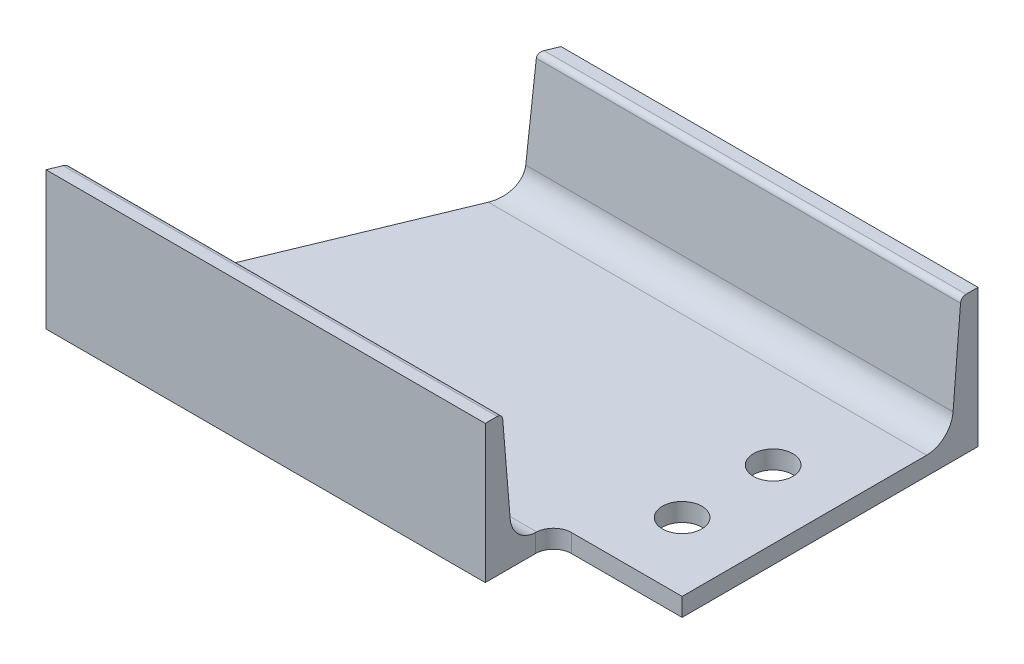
ISO-10303-21;
HEADER;
FILE_DESCRIPTION(('STEP AP214'),'2;1');
FILE_NAME('part.step','',(''),(''),'','','');
FILE_SCHEMA(('AUTOMOTIVE_DESIGN { 1 0 10303 214 1 1 1 1 }'));
ENDSEC;
DATA;
#1=APPLICATION_CONTEXT('core data for automotive mechanical design processes');
#2=APPLICATION_PROTOCOL_DEFINITION('international standard','automotive_design',2000,#1);
#3=PRODUCT_CONTEXT('',#1,'mechanical');
#4=PRODUCT('Part','Part','',(#3));
#5=PRODUCT_RELATED_PRODUCT_CATEGORY('part','',(#4));
#6=PRODUCT_DEFINITION_FORMATION('','',#4);
#7=PRODUCT_DEFINITION_CONTEXT('part definition',#1,'design');
#8=PRODUCT_DEFINITION('design','',#6,#7);
#9=PRODUCT_DEFINITION_SHAPE('','',#8);
#10=(LENGTH_UNIT() NAMED_UNIT(*) SI_UNIT(.MILLI.,.METRE.));
#11=(NAMED_UNIT(*) PLANE_ANGLE_UNIT() SI_UNIT($,.RADIAN.));
#12=(NAMED_UNIT(*) SI_UNIT($,.STERADIAN.) SOLID_ANGLE_UNIT());
#13=UNCERTAINTY_MEASURE_WITH_UNIT(LENGTH_MEASURE(1.E-05),#10,'distance_accuracy_value','');
#14=(GEOMETRIC_REPRESENTATION_CONTEXT(3) GLOBAL_UNCERTAINTY_ASSIGNED_CONTEXT((#13)) GLOBAL_UNIT_ASSIGNED_CONTEXT((#10,
#11,#12)) REPRESENTATION_CONTEXT('',''));
#15=CARTESIAN_POINT('',(0.,0.,0.));
#16=DIRECTION('',(0.,0.,1.));
#17=DIRECTION('',(1.,0.,0.));
#18=AXIS2_PLACEMENT_3D('',#15,#16,#17);
#19=CARTESIAN_POINT('',(345.,24.9951564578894,-174.498));
#20=DIRECTION('',(-1.,0.,0.));
#21=DIRECTION('',(0.,0.,1.));
#22=AXIS2_PLACEMENT_3D('',#19,#20,#21);
#23=CYLINDRICAL_SURFACE('',#22,14.8351564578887);
#24=DIRECTION('',(-1.,0.,0.));
#25=VECTOR('',#24,1.);
#26=CARTESIAN_POINT('',(345.,10.1600000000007,-174.498));
#27=LINE('',#26,#25);
#28=CARTESIAN_POINT('',(316.849999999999,10.1600000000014,-174.497999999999));
#29=VERTEX_POINT('',#28);
#30=CARTESIAN_POINT('',(72.2794382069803,10.1600000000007,-174.498));
#31=VERTEX_POINT('',#30);
#32=EDGE_CURVE('E255',#29,#31,#27,.T.);
#33=ORIENTED_EDGE('',*,*,#32,.F.);
#34=CARTESIAN_POINT('',(316.849999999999,24.9951564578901,-174.497999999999));
#35=DIRECTION('',(1.,0.,0.));
#36=DIRECTION('',(0.,0.,-1.));
#37=AXIS2_PLACEMENT_3D('',#34,#35,#36);
#38=CIRCLE('',#37,14.8351564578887);
#39=CARTESIAN_POINT('',(316.849999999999,23.7715448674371,-189.282608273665));
#40=VERTEX_POINT('',#39);
#41=EDGE_CURVE('E340',#40,#29,#38,.F.);
#42=ORIENTED_EDGE('',*,*,#41,.F.);
#43=DIRECTION('',(-1.,0.,0.));
#44=VECTOR('',#43,1.);
#45=CARTESIAN_POINT('',(345.,23.7715448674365,-189.282608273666));
#46=LINE('',#45,#44);
#47=CARTESIAN_POINT('',(78.4034234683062,23.7715448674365,-189.282608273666));
#48=VERTEX_POINT('',#47);
#49=EDGE_CURVE('E229',#40,#48,#46,.T.);
#50=ORIENTED_EDGE('',*,*,#49,.T.);
#51=CARTESIAN_POINT('',(72.2794382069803,24.9951564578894,-174.498));
#52=DIRECTION('',(-0.923879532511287,0.,-0.38268343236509));
#53=DIRECTION('',(-0.38268343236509,0.,0.923879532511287));
#54=AXIS2_PLACEMENT_3D('',#51,#52,#53);
#55=ELLIPSE('',#54,16.0574576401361,14.8351564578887);
#56=EDGE_CURVE('E252',#48,#31,#55,.T.);
#57=ORIENTED_EDGE('',*,*,#56,.T.);
#58=EDGE_LOOP('',(#33,#42,#50,#57));
#59=FACE_BOUND('',#58,.T.);
#60=ADVANCED_FACE('F79',(#59),#23,.F.);
#61=CARTESIAN_POINT('',(345.,24.9951564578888,-28.7019999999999));
#62=DIRECTION('',(-1.,0.,0.));
#63=DIRECTION('',(0.,0.,1.));
#64=AXIS2_PLACEMENT_3D('',#61,#62,#63);
#65=CYLINDRICAL_SURFACE('',#64,14.8351564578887);
#66=CARTESIAN_POINT('',(245.099999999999,10.1722193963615,-28.0999999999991));
#67=CARTESIAN_POINT('',(245.099999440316,10.1681446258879,-28.2003830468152));
#68=CARTESIAN_POINT('',(245.101510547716,10.1650889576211,-28.30074123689));
#69=CARTESIAN_POINT('',(245.107556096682,10.1610158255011,-28.5014079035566));
#70=CARTESIAN_POINT('',(245.112090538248,10.1599983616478,-28.6017163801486));
#71=CARTESIAN_POINT('',(245.118136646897,10.1600000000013,-28.7019999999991));
#72=B_SPLINE_CURVE_WITH_KNOTS('',3,(#66,#67,#68,#69,#70,#71),.UNSPECIFIED.,.F.,.F.,(4,2,4),(0.,
0.301248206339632,0.602496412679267),.UNSPECIFIED.);
#73=CARTESIAN_POINT('',(245.099999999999,10.1722193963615,-28.0999999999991));
#74=VERTEX_POINT('',#73);
#75=CARTESIAN_POINT('',(245.118136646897,10.1600000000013,-28.7019999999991));
#76=VERTEX_POINT('',#75);
#77=EDGE_CURVE('E201',#74,#76,#72,.T.);
#78=ORIENTED_EDGE('',*,*,#77,.T.);
#79=DIRECTION('',(-1.,0.,0.));
#80=VECTOR('',#79,1.);
#81=CARTESIAN_POINT('',(345.,10.1600000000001,-28.702));
#82=LINE('',#81,#80);
#83=CARTESIAN_POINT('',(11.8887576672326,10.1600000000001,-28.702));
#84=VERTEX_POINT('',#83);
#85=EDGE_CURVE('E259',#76,#84,#82,.T.);
#86=ORIENTED_EDGE('',*,*,#85,.T.);
#87=CARTESIAN_POINT('',(11.8887576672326,24.9951564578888,-28.7019999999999));
#88=DIRECTION('',(-0.923879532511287,0.,-0.38268343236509));
#89=DIRECTION('',(-0.38268343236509,0.,0.923879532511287));
#90=AXIS2_PLACEMENT_3D('',#87,#88,#89);
#91=ELLIPSE('',#90,16.0574576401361,14.8351564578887);
#92=CARTESIAN_POINT('',(5.76477240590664,23.7715448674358,-13.9173917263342));
#93=VERTEX_POINT('',#92);
#94=EDGE_CURVE('E251',#93,#84,#91,.F.);
#95=ORIENTED_EDGE('',*,*,#94,.F.);
#96=DIRECTION('',(-1.,0.,0.));
#97=VECTOR('',#96,1.);
#98=CARTESIAN_POINT('',(345.,23.7715448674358,-13.9173917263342));
#99=LINE('',#98,#97);
#100=CARTESIAN_POINT('',(245.099999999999,23.7715448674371,-13.9173917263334));
#101=VERTEX_POINT('',#100);
#102=EDGE_CURVE('E213',#101,#93,#99,.T.);
#103=ORIENTED_EDGE('',*,*,#102,.F.);
#104=CARTESIAN_POINT('',(245.099999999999,24.99515645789,-28.7019999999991));
#105=DIRECTION('',(1.,0.,0.));
#106=DIRECTION('',(0.,0.,-1.));
#107=AXIS2_PLACEMENT_3D('',#104,#105,#106);
#108=CIRCLE('',#107,14.8351564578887);
#109=EDGE_CURVE('E191',#101,#74,#108,.T.);
#110=ORIENTED_EDGE('',*,*,#109,.T.);
#111=EDGE_LOOP('',(#78,#86,#95,#103,#110));
#112=FACE_BOUND('',#111,.T.);
#113=ADVANCED_FACE('F211',(#112),#65,.F.);
#114=CARTESIAN_POINT('',(345.,74.1364296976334,-9.74906641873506));
#115=DIRECTION('',(0.,0.0824805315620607,-0.996592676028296));
#116=DIRECTION('',(0.,0.996592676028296,0.0824805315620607));
#117=AXIS2_PLACEMENT_3D('',#114,#115,#116);
#118=PLANE('',#117);
#119=DIRECTION('',(-1.,0.,0.));
#120=VECTOR('',#119,1.);
#121=CARTESIAN_POINT('',(345.,74.1364296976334,-9.74906641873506));
#122=LINE('',#121,#120);
#123=CARTESIAN_POINT('',(245.099999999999,74.1364296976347,-9.74906641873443));
#124=VERTEX_POINT('',#123);
#125=CARTESIAN_POINT('',(4.03819553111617,74.1364296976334,-9.74906641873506));
#126=VERTEX_POINT('',#125);
#127=EDGE_CURVE('E265',#124,#126,#122,.T.);
#128=ORIENTED_EDGE('',*,*,#127,.F.);
#129=DIRECTION('',(0.,0.996592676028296,0.0824805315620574));
#130=VECTOR('',#129,1.);
#131=CARTESIAN_POINT('',(245.099999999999,74.1364296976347,-9.74906641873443));
#132=LINE('',#131,#130);
#133=EDGE_CURVE('E303',#101,#124,#132,.T.);
#134=ORIENTED_EDGE('',*,*,#133,.F.);
#135=ORIENTED_EDGE('',*,*,#102,.T.);
#136=DIRECTION('',(-0.0341446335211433,0.996011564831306,0.0824324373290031));
#137=VECTOR('',#136,1.);
#138=CARTESIAN_POINT('',(4.43570789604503,62.5408472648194,-10.7087461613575));
#139=LINE('',#138,#137);
#140=EDGE_CURVE('E262',#93,#126,#139,.T.);
#141=ORIENTED_EDGE('',*,*,#140,.T.);
#142=EDGE_LOOP('',(#128,#134,#135,#141));
#143=FACE_BOUND('',#142,.T.);
#144=ADVANCED_FACE('F332',(#143),#118,.T.);
#145=CARTESIAN_POINT('',(345.,73.8824246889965,-6.67998421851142));
#146=DIRECTION('',(-1.,0.,0.));
#147=DIRECTION('',(0.,0.,1.));
#148=AXIS2_PLACEMENT_3D('',#145,#146,#147);
#149=CYLINDRICAL_SURFACE('',#148,3.0795753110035);
#150=CARTESIAN_POINT('',(245.099999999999,73.8824246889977,-6.67998421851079));
#151=DIRECTION('',(1.,0.,0.));
#152=DIRECTION('',(0.,0.,-1.));
#153=AXIS2_PLACEMENT_3D('',#150,#151,#152);
#154=CIRCLE('',#153,3.0795753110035);
#155=CARTESIAN_POINT('',(245.099999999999,76.9620000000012,-6.67998421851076));
#156=VERTEX_POINT('',#155);
#157=EDGE_CURVE('E306',#156,#124,#154,.F.);
#158=ORIENTED_EDGE('',*,*,#157,.T.);
#159=ORIENTED_EDGE('',*,*,#127,.T.);
#160=CARTESIAN_POINT('',(2.76694005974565,73.8824246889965,-6.67998421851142));
#161=DIRECTION('',(-0.923879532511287,0.,-0.38268343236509));
#162=DIRECTION('',(-0.38268343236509,0.,0.923879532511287));
#163=AXIS2_PLACEMENT_3D('',#160,#161,#162);
#164=ELLIPSE('',#163,3.33330829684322,3.0795753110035);
#165=CARTESIAN_POINT('',(2.76694005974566,76.962,-6.67998421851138));
#166=VERTEX_POINT('',#165);
#167=EDGE_CURVE('E231',#166,#126,#164,.T.);
#168=ORIENTED_EDGE('',*,*,#167,.F.);
#169=DIRECTION('',(-1.,0.,0.));
#170=VECTOR('',#169,1.);
#171=CARTESIAN_POINT('',(345.,76.962,-6.67998421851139));
#172=LINE('',#171,#170);
#173=EDGE_CURVE('E269',#156,#166,#172,.T.);
#174=ORIENTED_EDGE('',*,*,#173,.F.);
#175=EDGE_LOOP('',(#158,#159,#168,#174));
#176=FACE_BOUND('',#175,.T.);
#177=ADVANCED_FACE('F335',(#176),#149,.T.);
#178=CARTESIAN_POINT('',(345.,76.962,2.63677968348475E-13));
#179=DIRECTION('',(0.,1.,0.));
#180=DIRECTION('',(0.,0.,1.));
#181=AXIS2_PLACEMENT_3D('',#178,#179,#180);
#182=PLANE('',#181);
#183=DIRECTION('',(-1.,0.,0.));
#184=VECTOR('',#183,1.);
#185=CARTESIAN_POINT('',(345.,76.962,2.63677968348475E-13));
#186=LINE('',#185,#184);
#187=CARTESIAN_POINT('',(245.099999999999,76.962,2.63677968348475E-13));
#188=VERTEX_POINT('',#187);
#189=CARTESIAN_POINT('',(0.,76.9620000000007,0.));
#190=VERTEX_POINT('',#189);
#191=EDGE_CURVE('E103',#188,#190,#186,.T.);
#192=ORIENTED_EDGE('',*,*,#191,.F.);
#193=DIRECTION('',(0.,0.,1.));
#194=VECTOR('',#193,1.);
#195=CARTESIAN_POINT('',(245.099999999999,76.9620000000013,8.53124922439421E-13));
#196=LINE('',#195,#194);
#197=EDGE_CURVE('E96',#156,#188,#196,.T.);
#198=ORIENTED_EDGE('',*,*,#197,.F.);
#199=ORIENTED_EDGE('',*,*,#173,.T.);
#200=DIRECTION('',(-0.38268343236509,0.,0.923879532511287));
#201=VECTOR('',#200,1.);
#202=CARTESIAN_POINT('',(50.5240802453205,76.9619999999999,-121.975919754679));
#203=LINE('',#202,#201);
#204=EDGE_CURVE('E235',#166,#190,#203,.T.);
#205=ORIENTED_EDGE('',*,*,#204,.T.);
#206=EDGE_LOOP('',(#192,#198,#199,#205));
#207=FACE_BOUND('',#206,.T.);
#208=ADVANCED_FACE('F290',(#207),#182,.T.);
#209=CARTESIAN_POINT('',(345.,0.,0.));
#210=DIRECTION('',(0.,1.,0.));
#211=DIRECTION('',(0.,0.,1.));
#212=AXIS2_PLACEMENT_3D('',#209,#210,#211);
#213=PLANE('',#212);
#214=CARTESIAN_POINT('',(278.749999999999,2.63677968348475E-13,-76.1999999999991));
#215=DIRECTION('',(0.,1.,0.));
#216=DIRECTION('',(0.,0.,1.));
#217=AXIS2_PLACEMENT_3D('',#214,#215,#216);
#218=CIRCLE('',#217,11.);
#219=CARTESIAN_POINT('',(278.749999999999,2.24803518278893E-13,-65.1999999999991));
#220=VERTEX_POINT('',#219);
#221=EDGE_CURVE('E225',#220,#220,#218,.F.);
#222=ORIENTED_EDGE('',*,*,#221,.F.);
#223=EDGE_LOOP('',(#222));
#224=FACE_BOUND('',#223,.T.);
#225=CARTESIAN_POINT('',(278.749999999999,4.44089209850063E-13,-126.999999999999));
#226=DIRECTION('',(0.,1.,0.));
#227=DIRECTION('',(0.,0.,1.));
#228=AXIS2_PLACEMENT_3D('',#225,#226,#227);
#229=CIRCLE('',#228,11.);
#230=CARTESIAN_POINT('',(278.749999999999,4.05214759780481E-13,-115.999999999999));
#231=VERTEX_POINT('',#230);
#232=EDGE_CURVE('E83',#231,#231,#229,.F.);
#233=ORIENTED_EDGE('',*,*,#232,.F.);
#234=EDGE_LOOP('',(#233));
#235=FACE_BOUND('',#234,.T.);
#236=DIRECTION('',(0.,0.,1.));
#237=VECTOR('',#236,1.);
#238=CARTESIAN_POINT('',(316.849999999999,1.28332885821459E-12,8.38839928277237E-13));
#239=LINE('',#238,#237);
#240=CARTESIAN_POINT('',(316.849999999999,1.31686178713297E-12,-203.199999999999));
#241=VERTEX_POINT('',#240);
#242=CARTESIAN_POINT('',(316.849999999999,1.28142238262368E-12,-38.0999999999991));
#243=VERTEX_POINT('',#242);
#244=EDGE_CURVE('E297',#241,#243,#239,.T.);
#245=ORIENTED_EDGE('',*,*,#244,.T.);
#246=DIRECTION('',(-1.,0.,0.));
#247=VECTOR('',#246,1.);
#248=CARTESIAN_POINT('',(-55.0000000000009,1.28961628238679E-12,-38.0999999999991));
#249=LINE('',#248,#247);
#250=CARTESIAN_POINT('',(255.099999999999,1.28142238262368E-12,-38.0999999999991));
#251=VERTEX_POINT('',#250);
#252=EDGE_CURVE('E299',#243,#251,#249,.T.);
#253=ORIENTED_EDGE('',*,*,#252,.T.);
#254=CARTESIAN_POINT('',(255.099999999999,1.28019773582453E-12,-28.0999999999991));
#255=DIRECTION('',(0.,-1.,0.));
#256=DIRECTION('',(0.,0.,1.));
#257=AXIS2_PLACEMENT_3D('',#254,#255,#256);
#258=CIRCLE('',#257,9.99999999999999);
#259=CARTESIAN_POINT('',(245.099999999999,1.28019773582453E-12,-28.0999999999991));
#260=VERTEX_POINT('',#259);
#261=EDGE_CURVE('E207',#251,#260,#258,.F.);
#262=ORIENTED_EDGE('',*,*,#261,.T.);
#263=DIRECTION('',(0.,0.,1.));
#264=VECTOR('',#263,1.);
#265=CARTESIAN_POINT('',(245.099999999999,1.28332885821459E-12,8.39427546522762E-13));
#266=LINE('',#265,#264);
#267=CARTESIAN_POINT('',(245.099999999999,1.28332885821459E-12,8.75944198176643E-13));
#268=VERTEX_POINT('',#267);
#269=EDGE_CURVE('E194',#260,#268,#266,.T.);
#270=ORIENTED_EDGE('',*,*,#269,.T.);
#271=DIRECTION('',(-1.,0.,0.));
#272=VECTOR('',#271,1.);
#273=CARTESIAN_POINT('',(345.,0.,0.));
#274=LINE('',#273,#272);
#275=CARTESIAN_POINT('',(0.,0.,0.));
#276=VERTEX_POINT('',#275);
#277=EDGE_CURVE('E233',#268,#276,#274,.T.);
#278=ORIENTED_EDGE('',*,*,#277,.T.);
#279=DIRECTION('',(-0.38268343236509,0.,0.923879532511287));
#280=VECTOR('',#279,1.);
#281=CARTESIAN_POINT('',(50.5240802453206,4.26564272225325E-13,-121.975919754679));
#282=LINE('',#281,#280);
#283=CARTESIAN_POINT('',(84.1681958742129,7.13613495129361E-13,-203.2));
#284=VERTEX_POINT('',#283);
#285=EDGE_CURVE('E88',#284,#276,#282,.T.);
#286=ORIENTED_EDGE('',*,*,#285,.F.);
#287=DIRECTION('',(-1.,0.,0.));
#288=VECTOR('',#287,1.);
#289=CARTESIAN_POINT('',(345.,7.13613495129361E-13,-203.2));
#290=LINE('',#289,#288);
#291=EDGE_CURVE('E234',#241,#284,#290,.T.);
#292=ORIENTED_EDGE('',*,*,#291,.F.);
#293=EDGE_LOOP('',(#245,#253,#262,#270,#278,#286,#292));
#294=FACE_BOUND('',#293,.T.);
#295=ADVANCED_FACE('F286',(#224,#235,#294),#213,.F.);
#296=CARTESIAN_POINT('',(345.,7.13613495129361E-13,-203.2));
#297=DIRECTION('',(0.,0.,1.));
#298=DIRECTION('',(0.,-1.,0.));
#299=AXIS2_PLACEMENT_3D('',#296,#297,#298);
#300=PLANE('',#299);
#301=DIRECTION('',(0.,-1.,0.));
#302=VECTOR('',#301,1.);
#303=CARTESIAN_POINT('',(316.849999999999,1.31686178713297E-12,-203.199999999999));
#304=LINE('',#303,#302);
#305=CARTESIAN_POINT('',(316.849999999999,76.9620000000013,-203.199999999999));
#306=VERTEX_POINT('',#305);
#307=EDGE_CURVE('E304',#306,#241,#304,.T.);
#308=ORIENTED_EDGE('',*,*,#307,.T.);
#309=ORIENTED_EDGE('',*,*,#291,.T.);
#310=DIRECTION('',(0.,-1.,0.));
#311=VECTOR('',#310,1.);
#312=CARTESIAN_POINT('',(84.1681958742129,3.71116352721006E-13,-203.2));
#313=LINE('',#312,#311);
#314=CARTESIAN_POINT('',(84.1681958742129,76.9620000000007,-203.2));
#315=VERTEX_POINT('',#314);
#316=EDGE_CURVE('E239',#315,#284,#313,.T.);
#317=ORIENTED_EDGE('',*,*,#316,.F.);
#318=DIRECTION('',(-1.,0.,0.));
#319=VECTOR('',#318,1.);
#320=CARTESIAN_POINT('',(345.,76.9620000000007,-203.2));
#321=LINE('',#320,#319);
#322=EDGE_CURVE('E276',#306,#315,#321,.T.);
#323=ORIENTED_EDGE('',*,*,#322,.F.);
#324=EDGE_LOOP('',(#308,#309,#317,#323));
#325=FACE_BOUND('',#324,.T.);
#326=ADVANCED_FACE('F289',(#325),#300,.F.);
#327=CARTESIAN_POINT('',(345.,76.9620000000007,-203.2));
#328=DIRECTION('',(0.,-1.,0.));
#329=DIRECTION('',(0.,0.,-1.));
#330=AXIS2_PLACEMENT_3D('',#327,#328,#329);
#331=PLANE('',#330);
#332=DIRECTION('',(0.,0.,-1.));
#333=VECTOR('',#332,1.);
#334=CARTESIAN_POINT('',(316.849999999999,76.9620000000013,-203.199999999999));
#335=LINE('',#334,#333);
#336=CARTESIAN_POINT('',(316.849999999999,76.9620000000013,-196.520015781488));
#337=VERTEX_POINT('',#336);
#338=EDGE_CURVE('E308',#337,#306,#335,.T.);
#339=ORIENTED_EDGE('',*,*,#338,.T.);
#340=ORIENTED_EDGE('',*,*,#322,.T.);
#341=DIRECTION('',(0.38268343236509,0.,-0.923879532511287));
#342=VECTOR('',#341,1.);
#343=CARTESIAN_POINT('',(122.366129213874,76.9620000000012,-295.417968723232));
#344=LINE('',#343,#342);
#345=CARTESIAN_POINT('',(81.4012558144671,76.9620000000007,-196.520015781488));
#346=VERTEX_POINT('',#345);
#347=EDGE_CURVE('E242',#346,#315,#344,.T.);
#348=ORIENTED_EDGE('',*,*,#347,.F.);
#349=DIRECTION('',(-1.,0.,0.));
#350=VECTOR('',#349,1.);
#351=CARTESIAN_POINT('',(345.,76.9620000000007,-196.520015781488));
#352=LINE('',#351,#350);
#353=EDGE_CURVE('E278',#337,#346,#352,.T.);
#354=ORIENTED_EDGE('',*,*,#353,.F.);
#355=EDGE_LOOP('',(#339,#340,#348,#354));
#356=FACE_BOUND('',#355,.T.);
#357=ADVANCED_FACE('F359',(#356),#331,.F.);
#358=CARTESIAN_POINT('',(345.,73.8824246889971,-196.520015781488));
#359=DIRECTION('',(-1.,0.,0.));
#360=DIRECTION('',(0.,0.,1.));
#361=AXIS2_PLACEMENT_3D('',#358,#359,#360);
#362=CYLINDRICAL_SURFACE('',#361,3.0795753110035);
#363=CARTESIAN_POINT('',(316.849999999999,73.8824246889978,-196.520015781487));
#364=DIRECTION('',(1.,0.,0.));
#365=DIRECTION('',(0.,0.,-1.));
#366=AXIS2_PLACEMENT_3D('',#363,#364,#365);
#367=CIRCLE('',#366,3.0795753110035);
#368=CARTESIAN_POINT('',(316.849999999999,74.1364296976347,-193.450933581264));
#369=VERTEX_POINT('',#368);
#370=EDGE_CURVE('E353',#369,#337,#367,.F.);
#371=ORIENTED_EDGE('',*,*,#370,.T.);
#372=ORIENTED_EDGE('',*,*,#353,.T.);
#373=CARTESIAN_POINT('',(81.401255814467,73.8824246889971,-196.520015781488));
#374=DIRECTION('',(-0.923879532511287,0.,-0.38268343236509));
#375=DIRECTION('',(-0.38268343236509,0.,0.923879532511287));
#376=AXIS2_PLACEMENT_3D('',#373,#374,#375);
#377=ELLIPSE('',#376,3.33330829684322,3.0795753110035);
#378=CARTESIAN_POINT('',(80.1300003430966,74.1364296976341,-193.450933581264));
#379=VERTEX_POINT('',#378);
#380=EDGE_CURVE('E245',#379,#346,#377,.T.);
#381=ORIENTED_EDGE('',*,*,#380,.F.);
#382=DIRECTION('',(-1.,0.,0.));
#383=VECTOR('',#382,1.);
#384=CARTESIAN_POINT('',(345.,74.1364296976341,-193.450933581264));
#385=LINE('',#384,#383);
#386=EDGE_CURVE('E232',#369,#379,#385,.T.);
#387=ORIENTED_EDGE('',*,*,#386,.F.);
#388=EDGE_LOOP('',(#371,#372,#381,#387));
#389=FACE_BOUND('',#388,.T.);
#390=ADVANCED_FACE('F368',(#389),#362,.T.);
#391=CARTESIAN_POINT('',(345.,74.1364296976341,-193.450933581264));
#392=DIRECTION('',(0.,-0.0824805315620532,-0.996592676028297));
#393=DIRECTION('',(0.,0.996592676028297,-0.0824805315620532));
#394=AXIS2_PLACEMENT_3D('',#391,#392,#393);
#395=PLANE('',#394);
#396=DIRECTION('',(0.,0.996592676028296,-0.0824805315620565));
#397=VECTOR('',#396,1.);
#398=CARTESIAN_POINT('',(316.849999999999,74.1364296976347,-193.450933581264));
#399=LINE('',#398,#397);
#400=EDGE_CURVE('E350',#40,#369,#399,.T.);
#401=ORIENTED_EDGE('',*,*,#400,.T.);
#402=ORIENTED_EDGE('',*,*,#386,.T.);
#403=DIRECTION('',(0.0341446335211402,0.996011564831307,-0.0824324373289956));
#404=VECTOR('',#403,1.);
#405=CARTESIAN_POINT('',(80.4388006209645,83.1442478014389,-194.196443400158));
#406=LINE('',#405,#404);
#407=EDGE_CURVE('E248',#48,#379,#406,.T.);
#408=ORIENTED_EDGE('',*,*,#407,.F.);
#409=ORIENTED_EDGE('',*,*,#49,.F.);
#410=EDGE_LOOP('',(#401,#402,#408,#409));
#411=FACE_BOUND('',#410,.T.);
#412=ADVANCED_FACE('F373',(#411),#395,.F.);
#413=CARTESIAN_POINT('',(345.,0.,0.));
#414=DIRECTION('',(0.,0.,1.));
#415=DIRECTION('',(0.,-1.,0.));
#416=AXIS2_PLACEMENT_3D('',#413,#414,#415);
#417=PLANE('',#416);
#418=ORIENTED_EDGE('',*,*,#277,.F.);
#419=DIRECTION('',(0.,-1.,0.));
#420=VECTOR('',#419,1.);
#421=CARTESIAN_POINT('',(245.099999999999,1.28332885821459E-12,8.75944198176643E-13));
#422=LINE('',#421,#420);
#423=EDGE_CURVE('E315',#188,#268,#422,.T.);
#424=ORIENTED_EDGE('',*,*,#423,.F.);
#425=ORIENTED_EDGE('',*,*,#191,.T.);
#426=DIRECTION('',(0.,1.,0.));
#427=VECTOR('',#426,1.);
#428=CARTESIAN_POINT('',(0.,24.9951564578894,0.));
#429=LINE('',#428,#427);
#430=EDGE_CURVE('E13',#276,#190,#429,.T.);
#431=ORIENTED_EDGE('',*,*,#430,.F.);
#432=EDGE_LOOP('',(#418,#424,#425,#431));
#433=FACE_BOUND('',#432,.T.);
#434=ADVANCED_FACE('F338',(#433),#417,.T.);
#435=CARTESIAN_POINT('',(345.,10.1600000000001,-28.702));
#436=DIRECTION('',(0.,1.,0.));
#437=DIRECTION('',(0.,0.,1.));
#438=AXIS2_PLACEMENT_3D('',#435,#436,#437);
#439=PLANE('',#438);
#440=CARTESIAN_POINT('',(278.749999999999,10.1600000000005,-126.999999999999));
#441=DIRECTION('',(0.,1.,0.));
#442=DIRECTION('',(0.,0.,1.));
#443=AXIS2_PLACEMENT_3D('',#440,#441,#442);
#444=CIRCLE('',#443,11.);
#445=CARTESIAN_POINT('',(278.749999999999,10.1600000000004,-115.999999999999));
#446=VERTEX_POINT('',#445);
#447=EDGE_CURVE('E217',#446,#446,#444,.F.);
#448=ORIENTED_EDGE('',*,*,#447,.T.);
#449=EDGE_LOOP('',(#448));
#450=FACE_BOUND('',#449,.T.);
#451=CARTESIAN_POINT('',(278.749999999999,10.1600000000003,-76.1999999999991));
#452=DIRECTION('',(0.,1.,0.));
#453=DIRECTION('',(0.,0.,1.));
#454=AXIS2_PLACEMENT_3D('',#451,#452,#453);
#455=CIRCLE('',#454,11.);
#456=CARTESIAN_POINT('',(278.749999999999,10.1600000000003,-65.1999999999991));
#457=VERTEX_POINT('',#456);
#458=EDGE_CURVE('E226',#457,#457,#455,.F.);
#459=ORIENTED_EDGE('',*,*,#458,.T.);
#460=EDGE_LOOP('',(#459));
#461=FACE_BOUND('',#460,.T.);
#462=DIRECTION('',(-1.,0.,0.));
#463=VECTOR('',#462,1.);
#464=CARTESIAN_POINT('',(-55.000000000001,10.1600000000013,-38.0999999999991));
#465=LINE('',#464,#463);
#466=CARTESIAN_POINT('',(316.849999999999,10.1600000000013,-38.0999999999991));
#467=VERTEX_POINT('',#466);
#468=CARTESIAN_POINT('',(255.099999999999,10.1600000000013,-38.0999999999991));
#469=VERTEX_POINT('',#468);
#470=EDGE_CURVE('E219',#467,#469,#465,.T.);
#471=ORIENTED_EDGE('',*,*,#470,.F.);
#472=DIRECTION('',(0.,0.,1.));
#473=VECTOR('',#472,1.);
#474=CARTESIAN_POINT('',(316.849999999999,10.1600000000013,-28.7019999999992));
#475=LINE('',#474,#473);
#476=EDGE_CURVE('E214',#29,#467,#475,.T.);
#477=ORIENTED_EDGE('',*,*,#476,.F.);
#478=ORIENTED_EDGE('',*,*,#32,.T.);
#479=DIRECTION('',(-0.38268343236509,0.,0.923879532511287));
#480=VECTOR('',#479,1.);
#481=CARTESIAN_POINT('',(60.6717696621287,10.1600000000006,-146.474609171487));
#482=LINE('',#481,#480);
#483=EDGE_CURVE('E256',#31,#84,#482,.T.);
#484=ORIENTED_EDGE('',*,*,#483,.T.);
#485=ORIENTED_EDGE('',*,*,#85,.F.);
#486=CARTESIAN_POINT('',(255.099999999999,10.1600000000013,-28.0999999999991));
#487=DIRECTION('',(0.,-1.,0.));
#488=DIRECTION('',(0.,0.,1.));
#489=AXIS2_PLACEMENT_3D('',#486,#487,#488);
#490=CIRCLE('',#489,9.99999999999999);
#491=EDGE_CURVE('E204',#469,#76,#490,.F.);
#492=ORIENTED_EDGE('',*,*,#491,.F.);
#493=EDGE_LOOP('',(#471,#477,#478,#484,#485,#492));
#494=FACE_BOUND('',#493,.T.);
#495=ADVANCED_FACE('F324',(#450,#461,#494),#439,.T.);
#496=CARTESIAN_POINT('',(0.,0.,0.));
#497=DIRECTION('',(-0.923879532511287,0.,-0.38268343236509));
#498=DIRECTION('',(-0.38268343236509,0.,0.923879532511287));
#499=AXIS2_PLACEMENT_3D('',#496,#497,#498);
#500=PLANE('',#499);
#501=ORIENTED_EDGE('',*,*,#204,.F.);
#502=ORIENTED_EDGE('',*,*,#167,.T.);
#503=ORIENTED_EDGE('',*,*,#140,.F.);
#504=ORIENTED_EDGE('',*,*,#94,.T.);
#505=ORIENTED_EDGE('',*,*,#483,.F.);
#506=ORIENTED_EDGE('',*,*,#56,.F.);
#507=ORIENTED_EDGE('',*,*,#407,.T.);
#508=ORIENTED_EDGE('',*,*,#380,.T.);
#509=ORIENTED_EDGE('',*,*,#347,.T.);
#510=ORIENTED_EDGE('',*,*,#316,.T.);
#511=ORIENTED_EDGE('',*,*,#285,.T.);
#512=ORIENTED_EDGE('',*,*,#430,.T.);
#513=EDGE_LOOP('',(#501,#502,#503,#504,#505,#506,#507,#508,#509,#510,#511,#512));
#514=FACE_BOUND('',#513,.T.);
#515=ADVANCED_FACE('F81',(#514),#500,.T.);
#516=CARTESIAN_POINT('',(278.749999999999,-77.8399999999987,-76.1999999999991));
#517=DIRECTION('',(0.,1.,0.));
#518=DIRECTION('',(-1.,0.,0.));
#519=AXIS2_PLACEMENT_3D('',#516,#517,#518);
#520=CYLINDRICAL_SURFACE('',#519,11.);
#521=ORIENTED_EDGE('',*,*,#458,.F.);
#522=EDGE_LOOP('',(#521));
#523=FACE_BOUND('',#522,.T.);
#524=ORIENTED_EDGE('',*,*,#221,.T.);
#525=EDGE_LOOP('',(#524));
#526=FACE_BOUND('',#525,.T.);
#527=ADVANCED_FACE('F284',(#523,#526),#520,.F.);
#528=CARTESIAN_POINT('',(278.749999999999,-77.8399999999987,-126.999999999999));
#529=DIRECTION('',(0.,1.,0.));
#530=DIRECTION('',(-1.,0.,0.));
#531=AXIS2_PLACEMENT_3D('',#528,#529,#530);
#532=CYLINDRICAL_SURFACE('',#531,11.);
#533=ORIENTED_EDGE('',*,*,#447,.F.);
#534=EDGE_LOOP('',(#533));
#535=FACE_BOUND('',#534,.T.);
#536=ORIENTED_EDGE('',*,*,#232,.T.);
#537=EDGE_LOOP('',(#536));
#538=FACE_BOUND('',#537,.T.);
#539=ADVANCED_FACE('F404',(#535,#538),#532,.F.);
#540=CARTESIAN_POINT('',(255.099999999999,150.000000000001,-38.0999999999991));
#541=DIRECTION('',(0.,0.,1.));
#542=DIRECTION('',(1.,0.,0.));
#543=AXIS2_PLACEMENT_3D('',#540,#541,#542);
#544=PLANE('',#543);
#545=ORIENTED_EDGE('',*,*,#252,.F.);
#546=DIRECTION('',(0.,-1.,0.));
#547=VECTOR('',#546,1.);
#548=CARTESIAN_POINT('',(316.849999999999,150.000000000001,-38.0999999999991));
#549=LINE('',#548,#547);
#550=EDGE_CURVE('E208',#467,#243,#549,.T.);
#551=ORIENTED_EDGE('',*,*,#550,.F.);
#552=ORIENTED_EDGE('',*,*,#470,.T.);
#553=DIRECTION('',(0.,-1.,0.));
#554=VECTOR('',#553,1.);
#555=CARTESIAN_POINT('',(255.099999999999,150.000000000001,-38.0999999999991));
#556=LINE('',#555,#554);
#557=EDGE_CURVE('E198',#469,#251,#556,.T.);
#558=ORIENTED_EDGE('',*,*,#557,.T.);
#559=EDGE_LOOP('',(#545,#551,#552,#558));
#560=FACE_BOUND('',#559,.T.);
#561=ADVANCED_FACE('F321',(#560),#544,.T.);
#562=CARTESIAN_POINT('',(316.849999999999,150.000000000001,-38.0999999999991));
#563=DIRECTION('',(1.,0.,0.));
#564=DIRECTION('',(0.,0.,-1.));
#565=AXIS2_PLACEMENT_3D('',#562,#563,#564);
#566=PLANE('',#565);
#567=ORIENTED_EDGE('',*,*,#244,.F.);
#568=ORIENTED_EDGE('',*,*,#307,.F.);
#569=ORIENTED_EDGE('',*,*,#338,.F.);
#570=ORIENTED_EDGE('',*,*,#370,.F.);
#571=ORIENTED_EDGE('',*,*,#400,.F.);
#572=ORIENTED_EDGE('',*,*,#41,.T.);
#573=ORIENTED_EDGE('',*,*,#476,.T.);
#574=ORIENTED_EDGE('',*,*,#550,.T.);
#575=EDGE_LOOP('',(#567,#568,#569,#570,#571,#572,#573,#574));
#576=FACE_BOUND('',#575,.T.);
#577=ADVANCED_FACE('F369',(#576),#566,.T.);
#578=CARTESIAN_POINT('',(255.099999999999,150.000000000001,-28.0999999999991));
#579=DIRECTION('',(0.,-1.,0.));
#580=DIRECTION('',(1.,0.,0.));
#581=AXIS2_PLACEMENT_3D('',#578,#579,#580);
#582=CYLINDRICAL_SURFACE('',#581,9.99999999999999);
#583=ORIENTED_EDGE('',*,*,#261,.F.);
#584=ORIENTED_EDGE('',*,*,#557,.F.);
#585=ORIENTED_EDGE('',*,*,#491,.T.);
#586=ORIENTED_EDGE('',*,*,#77,.F.);
#587=DIRECTION('',(0.,-1.,0.));
#588=VECTOR('',#587,1.);
#589=CARTESIAN_POINT('',(245.099999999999,150.000000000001,-28.0999999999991));
#590=LINE('',#589,#588);
#591=EDGE_CURVE('E187',#74,#260,#590,.T.);
#592=ORIENTED_EDGE('',*,*,#591,.T.);
#593=EDGE_LOOP('',(#583,#584,#585,#586,#592));
#594=FACE_BOUND('',#593,.T.);
#595=ADVANCED_FACE('F202',(#594),#582,.F.);
#596=CARTESIAN_POINT('',(245.099999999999,150.000000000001,200.000000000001));
#597=DIRECTION('',(1.,0.,0.));
#598=DIRECTION('',(0.,0.,-1.));
#599=AXIS2_PLACEMENT_3D('',#596,#597,#598);
#600=PLANE('',#599);
#601=ORIENTED_EDGE('',*,*,#269,.F.);
#602=ORIENTED_EDGE('',*,*,#591,.F.);
#603=ORIENTED_EDGE('',*,*,#109,.F.);
#604=ORIENTED_EDGE('',*,*,#133,.T.);
#605=ORIENTED_EDGE('',*,*,#157,.F.);
#606=ORIENTED_EDGE('',*,*,#197,.T.);
#607=ORIENTED_EDGE('',*,*,#423,.T.);
#608=EDGE_LOOP('',(#601,#602,#603,#604,#605,#606,#607));
#609=FACE_BOUND('',#608,.T.);
#610=ADVANCED_FACE('F189',(#609),#600,.T.);
#611=CLOSED_SHELL('',(#60,#113,#144,#177,#208,#295,#326,#357,#390,#412,#434,#495,#515,#527,#539,
#561,#577,#595,#610));
#612=MANIFOLD_SOLID_BREP('B2',#611);
#613=ADVANCED_BREP_SHAPE_REPRESENTATION('',(#18,#612),#14);
#614=SHAPE_DEFINITION_REPRESENTATION(#9,#613);
ENDSEC;
END-ISO-10303-21;
